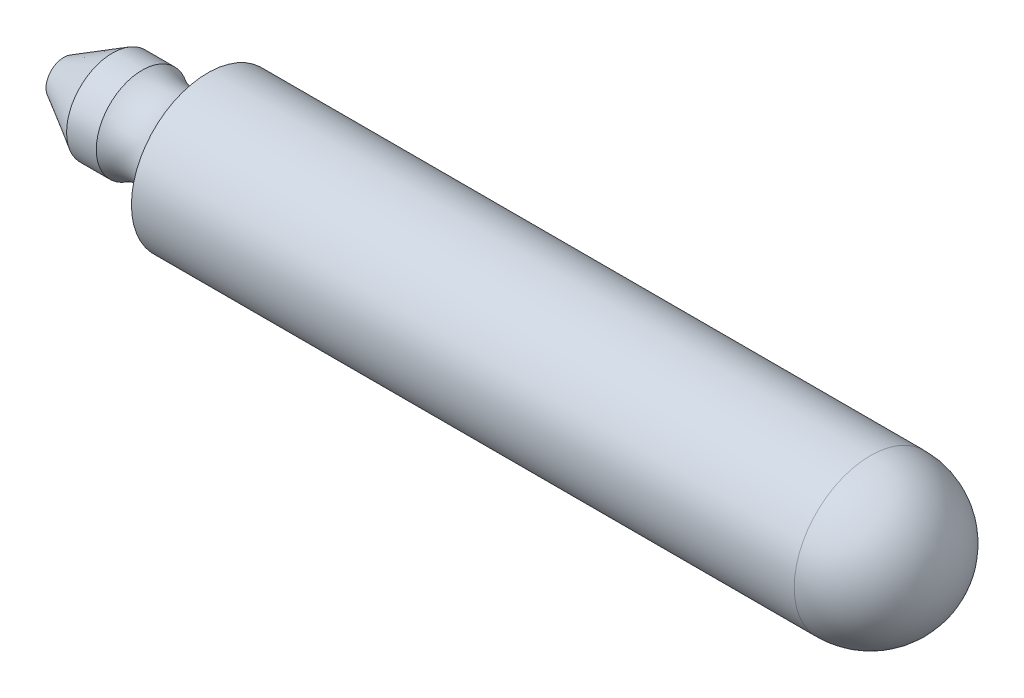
from build123d import *


with BuildPart() as part:
    # Sketch1 → Revolve1 (revolve)
    with BuildSketch(Plane.XY, mode=Mode.PRIVATE) as revolve1_sk:
        with BuildLine():
            Line((0, 0), (0, 0.3175))
            Line((0, 0.3175), (0.868883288, 0.81915))
            Line((0.868883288, 0.81915), (1.398725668, 0.81915))
            ThreePointArc((1.398725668, 0.81915), (2.130153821, 0.76892504), (2.5654, 1.3589))
            Line((2.5654, 1.3589), (14.3891, 1.3589))
            ThreePointArc((14.3891, 1.3589), (15.349987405, 0.960887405), (15.748, 0))
            Line((15.748, 0), (0, 0))
        make_face()
    revolve(revolve1_sk.sketch.rotate(Axis((0, 0, 0), (1, 0, 0)), 90), axis=Axis((0, 0, 0), (1, 0, 0)))


solid = part.part
